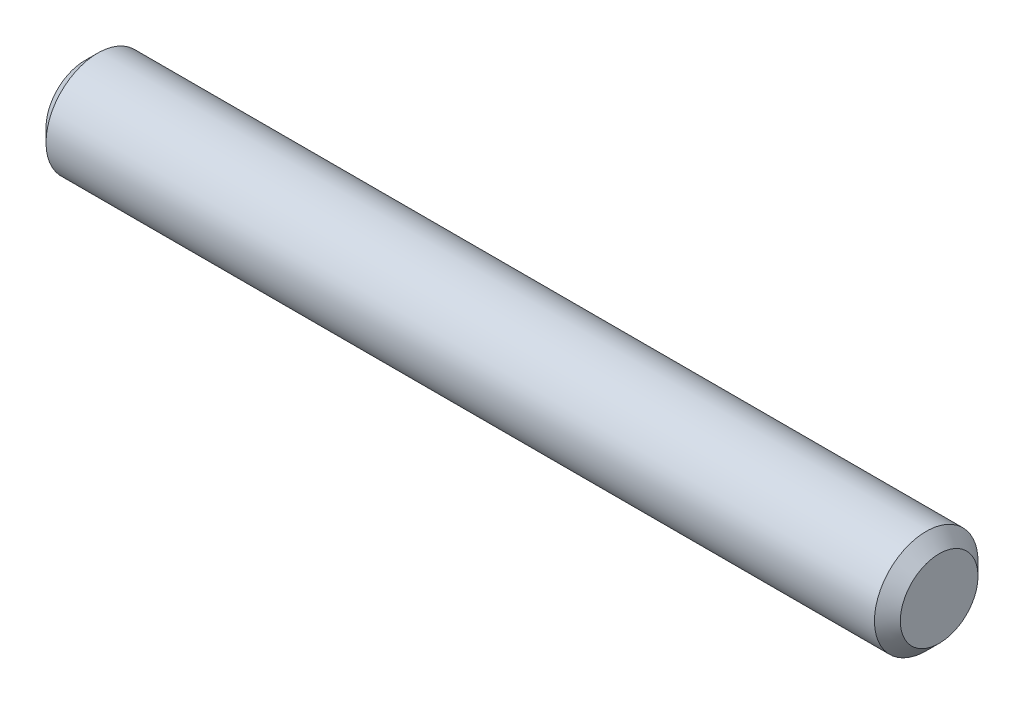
from build123d import *


with BuildPart() as part:
    # Esquisse1 → Base-R_volution (revolve)
    with BuildSketch(Plane.XY, mode=Mode.PRIVATE) as base_r_volution_sk:
        Polygon((0, 0), (0, 3), (1, 4), (65, 4), (66, 3), (66, 0), align=None)
    revolve(base_r_volution_sk.sketch.rotate(Axis((-3, 0, 0), (1, 0, 0)), 90), axis=Axis((-3, 0, 0), (1, 0, 0)))


solid = part.part
